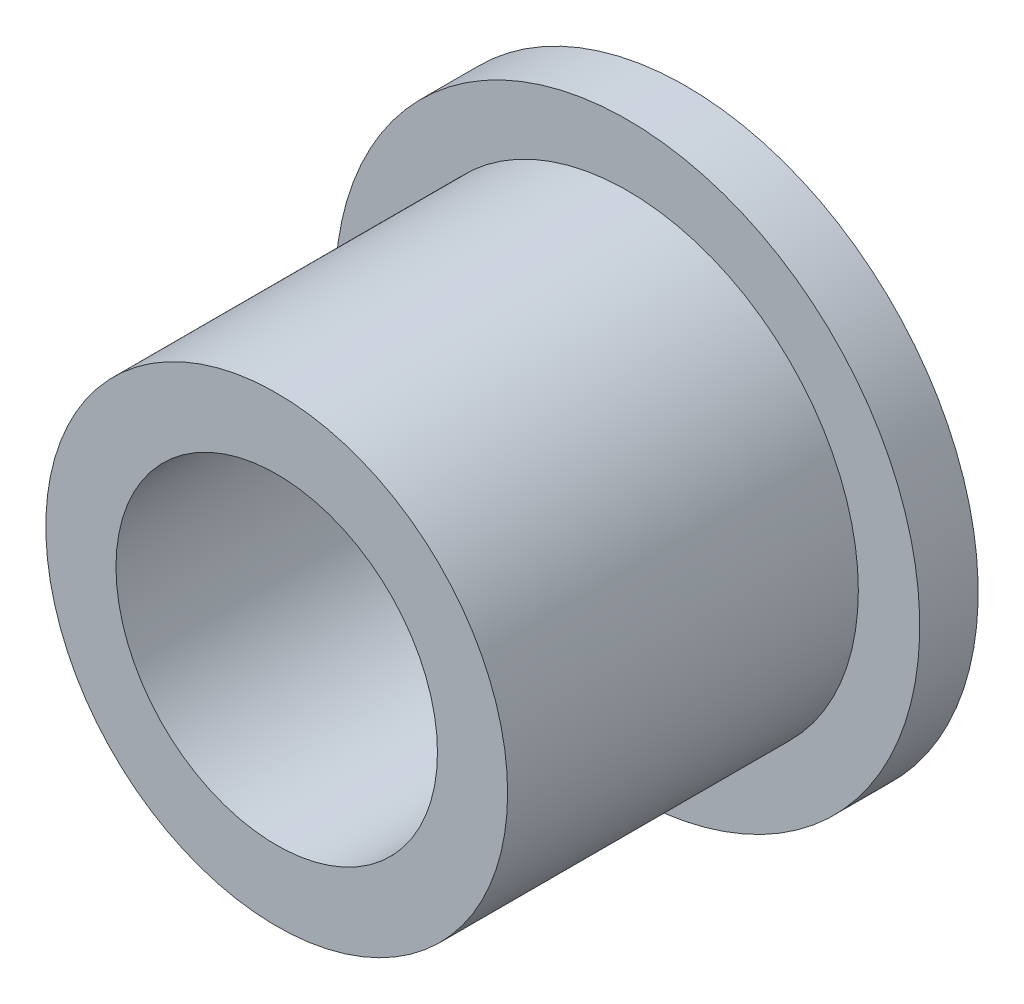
ISO-10303-21;
HEADER;
FILE_DESCRIPTION(('STEP AP214'),'2;1');
FILE_NAME('part.step','',(''),(''),'','','');
FILE_SCHEMA(('AUTOMOTIVE_DESIGN { 1 0 10303 214 1 1 1 1 }'));
ENDSEC;
DATA;
#1=APPLICATION_CONTEXT('core data for automotive mechanical design processes');
#2=APPLICATION_PROTOCOL_DEFINITION('international standard','automotive_design',2000,#1);
#3=PRODUCT_CONTEXT('',#1,'mechanical');
#4=PRODUCT('Part','Part','',(#3));
#5=PRODUCT_RELATED_PRODUCT_CATEGORY('part','',(#4));
#6=PRODUCT_DEFINITION_FORMATION('','',#4);
#7=PRODUCT_DEFINITION_CONTEXT('part definition',#1,'design');
#8=PRODUCT_DEFINITION('design','',#6,#7);
#9=PRODUCT_DEFINITION_SHAPE('','',#8);
#10=(LENGTH_UNIT() NAMED_UNIT(*) SI_UNIT(.MILLI.,.METRE.));
#11=(NAMED_UNIT(*) PLANE_ANGLE_UNIT() SI_UNIT($,.RADIAN.));
#12=(NAMED_UNIT(*) SI_UNIT($,.STERADIAN.) SOLID_ANGLE_UNIT());
#13=UNCERTAINTY_MEASURE_WITH_UNIT(LENGTH_MEASURE(1.E-05),#10,'distance_accuracy_value','');
#14=(GEOMETRIC_REPRESENTATION_CONTEXT(3) GLOBAL_UNCERTAINTY_ASSIGNED_CONTEXT((#13)) GLOBAL_UNIT_ASSIGNED_CONTEXT((#10,
#11,#12)) REPRESENTATION_CONTEXT('',''));
#15=CARTESIAN_POINT('',(0.,0.,0.));
#16=DIRECTION('',(0.,0.,1.));
#17=DIRECTION('',(1.,0.,0.));
#18=AXIS2_PLACEMENT_3D('',#15,#16,#17);
#19=CARTESIAN_POINT('',(-111.5,129.,184.));
#20=DIRECTION('',(0.,0.,-1.));
#21=DIRECTION('',(-1.,0.,0.));
#22=AXIS2_PLACEMENT_3D('',#19,#20,#21);
#23=PLANE('',#22);
#24=CARTESIAN_POINT('',(-111.5,129.,184.));
#25=DIRECTION('',(0.,0.,-1.));
#26=DIRECTION('',(-1.,0.,0.));
#27=AXIS2_PLACEMENT_3D('',#24,#25,#26);
#28=CIRCLE('',#27,5.);
#29=CARTESIAN_POINT('',(-116.5,129.,184.));
#30=VERTEX_POINT('',#29);
#31=EDGE_CURVE('E18',#30,#30,#28,.F.);
#32=ORIENTED_EDGE('',*,*,#31,.F.);
#33=EDGE_LOOP('',(#32));
#34=FACE_BOUND('',#33,.T.);
#35=CARTESIAN_POINT('',(-111.5,129.,184.));
#36=DIRECTION('',(0.,0.,1.));
#37=DIRECTION('',(1.,0.,0.));
#38=AXIS2_PLACEMENT_3D('',#35,#36,#37);
#39=CIRCLE('',#38,2.75);
#40=CARTESIAN_POINT('',(-108.75,129.,184.));
#41=VERTEX_POINT('',#40);
#42=EDGE_CURVE('E34',#41,#41,#39,.T.);
#43=ORIENTED_EDGE('',*,*,#42,.T.);
#44=EDGE_LOOP('',(#43));
#45=FACE_BOUND('',#44,.T.);
#46=ADVANCED_FACE('F15',(#34,#45),#23,.T.);
#47=CARTESIAN_POINT('',(-111.5,129.,184.5));
#48=DIRECTION('',(0.,0.,-1.));
#49=DIRECTION('',(-1.,0.,0.));
#50=AXIS2_PLACEMENT_3D('',#47,#48,#49);
#51=CYLINDRICAL_SURFACE('',#50,5.);
#52=CARTESIAN_POINT('',(-111.5,129.,185.));
#53=DIRECTION('',(0.,0.,-1.));
#54=DIRECTION('',(-1.,0.,0.));
#55=AXIS2_PLACEMENT_3D('',#52,#53,#54);
#56=CIRCLE('',#55,5.);
#57=CARTESIAN_POINT('',(-116.5,129.,185.));
#58=VERTEX_POINT('',#57);
#59=EDGE_CURVE('E32',#58,#58,#56,.F.);
#60=ORIENTED_EDGE('',*,*,#59,.F.);
#61=EDGE_LOOP('',(#60));
#62=FACE_BOUND('',#61,.T.);
#63=ORIENTED_EDGE('',*,*,#31,.T.);
#64=EDGE_LOOP('',(#63));
#65=FACE_BOUND('',#64,.T.);
#66=ADVANCED_FACE('F41',(#62,#65),#51,.T.);
#67=CARTESIAN_POINT('',(-111.5,129.,188.));
#68=DIRECTION('',(0.,0.,1.));
#69=DIRECTION('',(1.,0.,0.));
#70=AXIS2_PLACEMENT_3D('',#67,#68,#69);
#71=CYLINDRICAL_SURFACE('',#70,2.75);
#72=ORIENTED_EDGE('',*,*,#42,.F.);
#73=EDGE_LOOP('',(#72));
#74=FACE_BOUND('',#73,.T.);
#75=CARTESIAN_POINT('',(-111.5,129.,191.));
#76=DIRECTION('',(0.,0.,1.));
#77=DIRECTION('',(1.,0.,0.));
#78=AXIS2_PLACEMENT_3D('',#75,#76,#77);
#79=CIRCLE('',#78,2.75);
#80=CARTESIAN_POINT('',(-108.75,129.,191.));
#81=VERTEX_POINT('',#80);
#82=EDGE_CURVE('E27',#81,#81,#79,.F.);
#83=ORIENTED_EDGE('',*,*,#82,.F.);
#84=EDGE_LOOP('',(#83));
#85=FACE_BOUND('',#84,.T.);
#86=ADVANCED_FACE('F48',(#74,#85),#71,.F.);
#87=CARTESIAN_POINT('',(-111.5,129.,185.));
#88=DIRECTION('',(0.,0.,1.));
#89=DIRECTION('',(1.,0.,0.));
#90=AXIS2_PLACEMENT_3D('',#87,#88,#89);
#91=PLANE('',#90);
#92=ORIENTED_EDGE('',*,*,#59,.T.);
#93=EDGE_LOOP('',(#92));
#94=FACE_BOUND('',#93,.T.);
#95=CARTESIAN_POINT('',(-111.5,129.,185.));
#96=DIRECTION('',(0.,0.,1.));
#97=DIRECTION('',(1.,0.,0.));
#98=AXIS2_PLACEMENT_3D('',#95,#96,#97);
#99=CIRCLE('',#98,3.95);
#100=CARTESIAN_POINT('',(-107.55,129.,185.));
#101=VERTEX_POINT('',#100);
#102=EDGE_CURVE('E22',#101,#101,#99,.T.);
#103=ORIENTED_EDGE('',*,*,#102,.F.);
#104=EDGE_LOOP('',(#103));
#105=FACE_BOUND('',#104,.T.);
#106=ADVANCED_FACE('F58',(#94,#105),#91,.T.);
#107=CARTESIAN_POINT('',(-111.5,129.,191.));
#108=DIRECTION('',(0.,0.,1.));
#109=DIRECTION('',(1.,0.,0.));
#110=AXIS2_PLACEMENT_3D('',#107,#108,#109);
#111=PLANE('',#110);
#112=CARTESIAN_POINT('',(-111.5,129.,191.));
#113=DIRECTION('',(0.,0.,1.));
#114=DIRECTION('',(1.,0.,0.));
#115=AXIS2_PLACEMENT_3D('',#112,#113,#114);
#116=CIRCLE('',#115,3.95);
#117=CARTESIAN_POINT('',(-107.55,129.,191.));
#118=VERTEX_POINT('',#117);
#119=EDGE_CURVE('E10',#118,#118,#116,.F.);
#120=ORIENTED_EDGE('',*,*,#119,.F.);
#121=EDGE_LOOP('',(#120));
#122=FACE_BOUND('',#121,.T.);
#123=ORIENTED_EDGE('',*,*,#82,.T.);
#124=EDGE_LOOP('',(#123));
#125=FACE_BOUND('',#124,.T.);
#126=ADVANCED_FACE('F52',(#122,#125),#111,.T.);
#127=CARTESIAN_POINT('',(-111.5,129.,188.));
#128=DIRECTION('',(0.,0.,1.));
#129=DIRECTION('',(1.,0.,0.));
#130=AXIS2_PLACEMENT_3D('',#127,#128,#129);
#131=CYLINDRICAL_SURFACE('',#130,3.95);
#132=ORIENTED_EDGE('',*,*,#102,.T.);
#133=EDGE_LOOP('',(#132));
#134=FACE_BOUND('',#133,.T.);
#135=ORIENTED_EDGE('',*,*,#119,.T.);
#136=EDGE_LOOP('',(#135));
#137=FACE_BOUND('',#136,.T.);
#138=ADVANCED_FACE('F50',(#134,#137),#131,.T.);
#139=CLOSED_SHELL('',(#46,#66,#86,#106,#126,#138));
#140=MANIFOLD_SOLID_BREP('B1',#139);
#141=ADVANCED_BREP_SHAPE_REPRESENTATION('',(#18,#140),#14);
#142=SHAPE_DEFINITION_REPRESENTATION(#9,#141);
ENDSEC;
END-ISO-10303-21;
